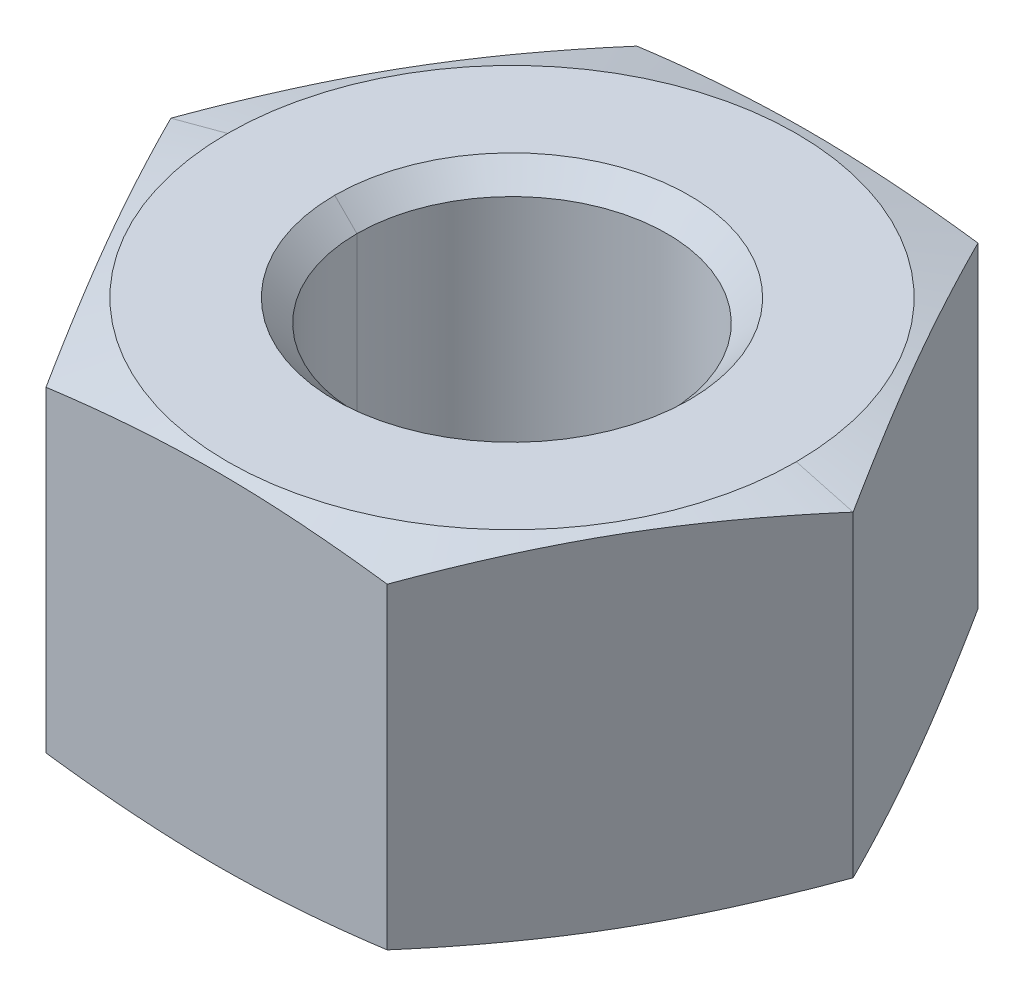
ISO-10303-21;
HEADER;
FILE_DESCRIPTION(('STEP AP214'),'2;1');
FILE_NAME('part.step','',(''),(''),'','','');
FILE_SCHEMA(('AUTOMOTIVE_DESIGN { 1 0 10303 214 1 1 1 1 }'));
ENDSEC;
DATA;
#1=APPLICATION_CONTEXT('core data for automotive mechanical design processes');
#2=APPLICATION_PROTOCOL_DEFINITION('international standard','automotive_design',2000,#1);
#3=PRODUCT_CONTEXT('',#1,'mechanical');
#4=PRODUCT('Part','Part','',(#3));
#5=PRODUCT_RELATED_PRODUCT_CATEGORY('part','',(#4));
#6=PRODUCT_DEFINITION_FORMATION('','',#4);
#7=PRODUCT_DEFINITION_CONTEXT('part definition',#1,'design');
#8=PRODUCT_DEFINITION('design','',#6,#7);
#9=PRODUCT_DEFINITION_SHAPE('','',#8);
#10=(LENGTH_UNIT() NAMED_UNIT(*) SI_UNIT(.MILLI.,.METRE.));
#11=(NAMED_UNIT(*) PLANE_ANGLE_UNIT() SI_UNIT($,.RADIAN.));
#12=(NAMED_UNIT(*) SI_UNIT($,.STERADIAN.) SOLID_ANGLE_UNIT());
#13=UNCERTAINTY_MEASURE_WITH_UNIT(LENGTH_MEASURE(1.E-05),#10,'distance_accuracy_value','');
#14=(GEOMETRIC_REPRESENTATION_CONTEXT(3) GLOBAL_UNCERTAINTY_ASSIGNED_CONTEXT((#13)) GLOBAL_UNIT_ASSIGNED_CONTEXT((#10,
#11,#12)) REPRESENTATION_CONTEXT('',''));
#15=CARTESIAN_POINT('',(0.,0.,0.));
#16=DIRECTION('',(0.,0.,1.));
#17=DIRECTION('',(1.,0.,0.));
#18=AXIS2_PLACEMENT_3D('',#15,#16,#17);
#19=CARTESIAN_POINT('',(131.9,7.,32.4989878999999));
#20=DIRECTION('',(0.,1.,0.));
#21=DIRECTION('',(1.,0.,0.));
#22=AXIS2_PLACEMENT_3D('',#19,#20,#21);
#23=CONICAL_SURFACE('',#22,2.4,0.785398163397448);
#24=DIRECTION('',(-0.707106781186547,0.707106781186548,0.));
#25=VECTOR('',#24,1.);
#26=CARTESIAN_POINT('',(129.5,7.,32.4989878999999));
#27=LINE('',#26,#25);
#28=CARTESIAN_POINT('',(129.8,6.7,32.4989878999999));
#29=VERTEX_POINT('',#28);
#30=CARTESIAN_POINT('',(129.5,7.,32.4989878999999));
#31=VERTEX_POINT('',#30);
#32=EDGE_CURVE('E165',#29,#31,#27,.T.);
#33=ORIENTED_EDGE('',*,*,#32,.F.);
#34=CARTESIAN_POINT('',(131.9,6.7,32.4989878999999));
#35=DIRECTION('',(0.,1.,0.));
#36=DIRECTION('',(1.,0.,0.));
#37=AXIS2_PLACEMENT_3D('',#34,#35,#36);
#38=CIRCLE('',#37,2.1);
#39=CARTESIAN_POINT('',(134.,6.7,32.4989878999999));
#40=VERTEX_POINT('',#39);
#41=EDGE_CURVE('E27',#40,#29,#38,.T.);
#42=ORIENTED_EDGE('',*,*,#41,.F.);
#43=DIRECTION('',(0.707106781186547,0.707106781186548,0.));
#44=VECTOR('',#43,1.);
#45=CARTESIAN_POINT('',(134.3,7.,32.4989878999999));
#46=LINE('',#45,#44);
#47=CARTESIAN_POINT('',(134.3,7.,32.4989878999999));
#48=VERTEX_POINT('',#47);
#49=EDGE_CURVE('E173',#40,#48,#46,.T.);
#50=ORIENTED_EDGE('',*,*,#49,.T.);
#51=CARTESIAN_POINT('',(131.9,7.,32.4989878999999));
#52=DIRECTION('',(0.,-1.,0.));
#53=DIRECTION('',(1.,0.,0.));
#54=AXIS2_PLACEMENT_3D('',#51,#52,#53);
#55=CIRCLE('',#54,2.4);
#56=EDGE_CURVE('E151',#31,#48,#55,.T.);
#57=ORIENTED_EDGE('',*,*,#56,.F.);
#58=EDGE_LOOP('',(#33,#42,#50,#57));
#59=FACE_BOUND('',#58,.T.);
#60=ADVANCED_FACE('F16',(#59),#23,.F.);
#61=CARTESIAN_POINT('',(131.9,2.6,32.4989878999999));
#62=DIRECTION('',(0.,-1.,0.));
#63=DIRECTION('',(-1.,0.,0.));
#64=AXIS2_PLACEMENT_3D('',#61,#62,#63);
#65=CONICAL_SURFACE('',#64,2.1,0.78539816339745);
#66=DIRECTION('',(0.707106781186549,-0.707106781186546,0.));
#67=VECTOR('',#66,1.);
#68=CARTESIAN_POINT('',(134.,2.6,32.4989878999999));
#69=LINE('',#68,#67);
#70=CARTESIAN_POINT('',(134.,2.6,32.4989878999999));
#71=VERTEX_POINT('',#70);
#72=CARTESIAN_POINT('',(134.3,2.3,32.4989878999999));
#73=VERTEX_POINT('',#72);
#74=EDGE_CURVE('E184',#71,#73,#69,.T.);
#75=ORIENTED_EDGE('',*,*,#74,.F.);
#76=CARTESIAN_POINT('',(131.9,2.6,32.4989878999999));
#77=DIRECTION('',(0.,-1.,0.));
#78=DIRECTION('',(1.,0.,0.));
#79=AXIS2_PLACEMENT_3D('',#76,#77,#78);
#80=CIRCLE('',#79,2.1);
#81=CARTESIAN_POINT('',(129.8,2.6,32.4989878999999));
#82=VERTEX_POINT('',#81);
#83=EDGE_CURVE('E11',#82,#71,#80,.T.);
#84=ORIENTED_EDGE('',*,*,#83,.F.);
#85=DIRECTION('',(-0.707106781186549,-0.707106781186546,0.));
#86=VECTOR('',#85,1.);
#87=CARTESIAN_POINT('',(129.8,2.6,32.4989878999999));
#88=LINE('',#87,#86);
#89=CARTESIAN_POINT('',(129.5,2.3,32.4989878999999));
#90=VERTEX_POINT('',#89);
#91=EDGE_CURVE('E193',#82,#90,#88,.T.);
#92=ORIENTED_EDGE('',*,*,#91,.T.);
#93=CARTESIAN_POINT('',(131.9,2.3,32.4989878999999));
#94=DIRECTION('',(0.,1.,0.));
#95=DIRECTION('',(1.,0.,0.));
#96=AXIS2_PLACEMENT_3D('',#93,#94,#95);
#97=CIRCLE('',#96,2.4);
#98=EDGE_CURVE('E197',#73,#90,#97,.T.);
#99=ORIENTED_EDGE('',*,*,#98,.F.);
#100=EDGE_LOOP('',(#75,#84,#92,#99));
#101=FACE_BOUND('',#100,.T.);
#102=ADVANCED_FACE('F547',(#101),#65,.F.);
#103=CARTESIAN_POINT('',(131.9,2.3,32.4989878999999));
#104=DIRECTION('',(0.,-1.,0.));
#105=DIRECTION('',(-1.,0.,0.));
#106=AXIS2_PLACEMENT_3D('',#103,#104,#105);
#107=CYLINDRICAL_SURFACE('',#106,2.1);
#108=DIRECTION('',(0.,-1.,0.));
#109=VECTOR('',#108,1.);
#110=CARTESIAN_POINT('',(134.,2.3,32.4989878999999));
#111=LINE('',#110,#109);
#112=EDGE_CURVE('E145',#40,#71,#111,.T.);
#113=ORIENTED_EDGE('',*,*,#112,.F.);
#114=ORIENTED_EDGE('',*,*,#41,.T.);
#115=DIRECTION('',(0.,-1.,0.));
#116=VECTOR('',#115,1.);
#117=CARTESIAN_POINT('',(129.8,2.3,32.4989878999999));
#118=LINE('',#117,#116);
#119=EDGE_CURVE('E142',#29,#82,#118,.T.);
#120=ORIENTED_EDGE('',*,*,#119,.T.);
#121=ORIENTED_EDGE('',*,*,#83,.T.);
#122=EDGE_LOOP('',(#113,#114,#120,#121));
#123=FACE_BOUND('',#122,.T.);
#124=ADVANCED_FACE('F141',(#123),#107,.F.);
#125=CARTESIAN_POINT('',(134.209401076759,7.,36.4989879));
#126=DIRECTION('',(0.,1.,0.));
#127=DIRECTION('',(1.,0.,0.));
#128=AXIS2_PLACEMENT_3D('',#125,#126,#127);
#129=PLANE('',#128);
#130=CARTESIAN_POINT('',(131.9,7.,32.4989878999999));
#131=DIRECTION('',(0.,-1.,0.));
#132=DIRECTION('',(1.,0.,0.));
#133=AXIS2_PLACEMENT_3D('',#130,#131,#132);
#134=CIRCLE('',#133,2.4);
#135=EDGE_CURVE('E170',#48,#31,#134,.T.);
#136=ORIENTED_EDGE('',*,*,#135,.T.);
#137=ORIENTED_EDGE('',*,*,#56,.T.);
#138=EDGE_LOOP('',(#136,#137));
#139=FACE_BOUND('',#138,.T.);
#140=CARTESIAN_POINT('',(131.9,7.,32.4989878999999));
#141=DIRECTION('',(0.,-1.,0.));
#142=DIRECTION('',(-1.,0.,0.));
#143=AXIS2_PLACEMENT_3D('',#140,#141,#142);
#144=CIRCLE('',#143,3.85);
#145=CARTESIAN_POINT('',(128.05,7.,32.4989878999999));
#146=VERTEX_POINT('',#145);
#147=CARTESIAN_POINT('',(135.75,7.,32.4989878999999));
#148=VERTEX_POINT('',#147);
#149=EDGE_CURVE('E162',#146,#148,#144,.T.);
#150=ORIENTED_EDGE('',*,*,#149,.F.);
#151=CARTESIAN_POINT('',(131.9,7.,32.4989878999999));
#152=DIRECTION('',(0.,-1.,0.));
#153=DIRECTION('',(-1.,0.,0.));
#154=AXIS2_PLACEMENT_3D('',#151,#152,#153);
#155=CIRCLE('',#154,3.85);
#156=EDGE_CURVE('E194',#148,#146,#155,.T.);
#157=ORIENTED_EDGE('',*,*,#156,.F.);
#158=EDGE_LOOP('',(#150,#157));
#159=FACE_BOUND('',#158,.T.);
#160=ADVANCED_FACE('F269',(#139,#159),#129,.T.);
#161=CARTESIAN_POINT('',(131.9,7.,32.4989878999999));
#162=DIRECTION('',(0.,-1.,0.));
#163=DIRECTION('',(-1.,0.,0.));
#164=AXIS2_PLACEMENT_3D('',#161,#162,#163);
#165=CONICAL_SURFACE('',#164,3.85,1.30899693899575);
#166=DIRECTION('',(0.96592582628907,-0.258819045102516,0.));
#167=VECTOR('',#166,1.);
#168=CARTESIAN_POINT('',(135.75,7.,32.4989878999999));
#169=LINE('',#168,#167);
#170=CARTESIAN_POINT('',(136.518802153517,6.79400008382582,32.4989878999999));
#171=VERTEX_POINT('',#170);
#172=EDGE_CURVE('E206',#148,#171,#169,.T.);
#173=ORIENTED_EDGE('',*,*,#172,.F.);
#174=ORIENTED_EDGE('',*,*,#156,.T.);
#175=DIRECTION('',(-0.96592582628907,-0.258819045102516,0.));
#176=VECTOR('',#175,1.);
#177=CARTESIAN_POINT('',(128.05,7.,32.4989878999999));
#178=LINE('',#177,#176);
#179=CARTESIAN_POINT('',(127.281197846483,6.79400008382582,32.4989878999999));
#180=VERTEX_POINT('',#179);
#181=EDGE_CURVE('E212',#146,#180,#178,.T.);
#182=ORIENTED_EDGE('',*,*,#181,.T.);
#183=CARTESIAN_POINT('',(129.590598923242,6.79400008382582,36.4989879));
#184=CARTESIAN_POINT('',(128.971948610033,6.959766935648,35.4274541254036));
#185=CARTESIAN_POINT('',(128.435898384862,6.95980762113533,34.4989878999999));
#186=CARTESIAN_POINT('',(127.900151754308,6.95984828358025,33.5710475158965));
#187=CARTESIAN_POINT('',(127.281197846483,6.79400008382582,32.4989878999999));
#188=B_SPLINE_CURVE_WITH_KNOTS('',2,(#183,#184,#185,#186,#187),.UNSPECIFIED.,.F.,.F.,(3,2,3),
(0.,0.5,1.),.UNSPECIFIED.);
#189=CARTESIAN_POINT('',(129.590598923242,6.79400008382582,36.4989879));
#190=VERTEX_POINT('',#189);
#191=EDGE_CURVE('E50',#190,#180,#188,.T.);
#192=ORIENTED_EDGE('',*,*,#191,.F.);
#193=CARTESIAN_POINT('',(134.209401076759,6.79400008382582,36.4989879));
#194=CARTESIAN_POINT('',(132.974256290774,6.95947810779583,36.4989879));
#195=CARTESIAN_POINT('',(131.904046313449,6.95980707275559,36.4989879));
#196=CARTESIAN_POINT('',(130.830661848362,6.96013701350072,36.4989879));
#197=CARTESIAN_POINT('',(129.590598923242,6.79400008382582,36.4989879));
#198=B_SPLINE_CURVE_WITH_KNOTS('',2,(#193,#194,#195,#196,#197),.UNSPECIFIED.,.F.,.F.,(3,2,3),
(0.,0.5,1.),.UNSPECIFIED.);
#199=CARTESIAN_POINT('',(134.209401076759,6.79400008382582,36.4989879));
#200=VERTEX_POINT('',#199);
#201=EDGE_CURVE('E327',#200,#190,#198,.T.);
#202=ORIENTED_EDGE('',*,*,#201,.F.);
#203=CARTESIAN_POINT('',(136.518802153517,6.79400008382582,32.4989878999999));
#204=CARTESIAN_POINT('',(135.900151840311,6.95976693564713,33.5705216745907));
#205=CARTESIAN_POINT('',(135.364101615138,6.95980762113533,34.4989878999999));
#206=CARTESIAN_POINT('',(134.828354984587,6.95984828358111,35.4269282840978));
#207=CARTESIAN_POINT('',(134.209401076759,6.79400008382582,36.4989879));
#208=B_SPLINE_CURVE_WITH_KNOTS('',2,(#203,#204,#205,#206,#207),.UNSPECIFIED.,.F.,.F.,(3,2,3),
(0.,0.5,1.),.UNSPECIFIED.);
#209=EDGE_CURVE('E512',#171,#200,#208,.T.);
#210=ORIENTED_EDGE('',*,*,#209,.F.);
#211=EDGE_LOOP('',(#173,#174,#182,#192,#202,#210));
#212=FACE_BOUND('',#211,.T.);
#213=ADVANCED_FACE('F258',(#212),#165,.T.);
#214=CARTESIAN_POINT('',(134.209401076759,2.3,36.4989879));
#215=DIRECTION('',(0.,1.,0.));
#216=DIRECTION('',(1.,0.,0.));
#217=AXIS2_PLACEMENT_3D('',#214,#215,#216);
#218=PLANE('',#217);
#219=CARTESIAN_POINT('',(131.9,2.3,32.4989878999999));
#220=DIRECTION('',(0.,1.,0.));
#221=DIRECTION('',(1.,0.,0.));
#222=AXIS2_PLACEMENT_3D('',#219,#220,#221);
#223=CIRCLE('',#222,2.4);
#224=EDGE_CURVE('E189',#90,#73,#223,.T.);
#225=ORIENTED_EDGE('',*,*,#224,.T.);
#226=ORIENTED_EDGE('',*,*,#98,.T.);
#227=EDGE_LOOP('',(#225,#226));
#228=FACE_BOUND('',#227,.T.);
#229=CARTESIAN_POINT('',(131.9,2.3,32.4989878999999));
#230=DIRECTION('',(0.,-1.,0.));
#231=DIRECTION('',(-1.,0.,0.));
#232=AXIS2_PLACEMENT_3D('',#229,#230,#231);
#233=CIRCLE('',#232,3.85);
#234=CARTESIAN_POINT('',(135.75,2.3,32.4989878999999));
#235=VERTEX_POINT('',#234);
#236=CARTESIAN_POINT('',(128.05,2.3,32.4989878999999));
#237=VERTEX_POINT('',#236);
#238=EDGE_CURVE('E213',#235,#237,#233,.T.);
#239=ORIENTED_EDGE('',*,*,#238,.T.);
#240=CARTESIAN_POINT('',(131.9,2.3,32.4989878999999));
#241=DIRECTION('',(0.,-1.,0.));
#242=DIRECTION('',(-1.,0.,0.));
#243=AXIS2_PLACEMENT_3D('',#240,#241,#242);
#244=CIRCLE('',#243,3.85);
#245=EDGE_CURVE('E207',#237,#235,#244,.T.);
#246=ORIENTED_EDGE('',*,*,#245,.T.);
#247=EDGE_LOOP('',(#239,#246));
#248=FACE_BOUND('',#247,.T.);
#249=ADVANCED_FACE('F268',(#228,#248),#218,.F.);
#250=CARTESIAN_POINT('',(131.9,2.50599991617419,32.4989878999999));
#251=DIRECTION('',(0.,1.,0.));
#252=DIRECTION('',(1.,0.,0.));
#253=AXIS2_PLACEMENT_3D('',#250,#251,#252);
#254=CONICAL_SURFACE('',#253,4.61880215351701,1.30899693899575);
#255=DIRECTION('',(-0.96592582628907,0.258819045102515,0.));
#256=VECTOR('',#255,1.);
#257=CARTESIAN_POINT('',(127.281197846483,2.50599991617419,32.4989878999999));
#258=LINE('',#257,#256);
#259=CARTESIAN_POINT('',(127.281197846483,2.50599991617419,32.4989878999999));
#260=VERTEX_POINT('',#259);
#261=EDGE_CURVE('E211',#237,#260,#258,.T.);
#262=ORIENTED_EDGE('',*,*,#261,.F.);
#263=ORIENTED_EDGE('',*,*,#238,.F.);
#264=DIRECTION('',(0.96592582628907,0.258819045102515,0.));
#265=VECTOR('',#264,1.);
#266=CARTESIAN_POINT('',(136.518802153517,2.50599991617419,32.4989878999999));
#267=LINE('',#266,#265);
#268=CARTESIAN_POINT('',(136.518802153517,2.50599991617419,32.4989878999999));
#269=VERTEX_POINT('',#268);
#270=EDGE_CURVE('E496',#235,#269,#267,.T.);
#271=ORIENTED_EDGE('',*,*,#270,.T.);
#272=CARTESIAN_POINT('',(134.209401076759,2.50599991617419,36.4989879));
#273=CARTESIAN_POINT('',(134.828051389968,2.340233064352,35.4274541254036));
#274=CARTESIAN_POINT('',(135.364101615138,2.34019237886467,34.4989878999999));
#275=CARTESIAN_POINT('',(135.899848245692,2.34015171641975,33.5710475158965));
#276=CARTESIAN_POINT('',(136.518802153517,2.50599991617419,32.4989878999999));
#277=B_SPLINE_CURVE_WITH_KNOTS('',2,(#272,#273,#274,#275,#276),.UNSPECIFIED.,.F.,.F.,(3,2,3),
(0.,0.5,1.),.UNSPECIFIED.);
#278=CARTESIAN_POINT('',(134.209401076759,2.50599991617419,36.4989879));
#279=VERTEX_POINT('',#278);
#280=EDGE_CURVE('E526',#279,#269,#277,.T.);
#281=ORIENTED_EDGE('',*,*,#280,.F.);
#282=CARTESIAN_POINT('',(129.590598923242,2.50599991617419,36.4989879));
#283=CARTESIAN_POINT('',(130.830089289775,2.33993969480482,36.4989879));
#284=CARTESIAN_POINT('',(131.904046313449,2.3401929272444,36.4989879));
#285=CARTESIAN_POINT('',(132.973683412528,2.34044514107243,36.4989879));
#286=CARTESIAN_POINT('',(134.209401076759,2.50599991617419,36.4989879));
#287=B_SPLINE_CURVE_WITH_KNOTS('',2,(#282,#283,#284,#285,#286),.UNSPECIFIED.,.F.,.F.,(3,2,3),
(0.,0.5,1.),.UNSPECIFIED.);
#288=CARTESIAN_POINT('',(129.590598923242,2.50599991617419,36.4989879));
#289=VERTEX_POINT('',#288);
#290=EDGE_CURVE('E296',#289,#279,#287,.T.);
#291=ORIENTED_EDGE('',*,*,#290,.F.);
#292=CARTESIAN_POINT('',(127.281197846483,2.50599991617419,32.4989878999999));
#293=CARTESIAN_POINT('',(127.899848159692,2.340233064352,33.5705216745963));
#294=CARTESIAN_POINT('',(128.435898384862,2.34019237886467,34.4989878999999));
#295=CARTESIAN_POINT('',(128.971645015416,2.34015171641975,35.4269282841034));
#296=CARTESIAN_POINT('',(129.590598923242,2.50599991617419,36.4989879));
#297=B_SPLINE_CURVE_WITH_KNOTS('',2,(#292,#293,#294,#295,#296),.UNSPECIFIED.,.F.,.F.,(3,2,3),
(0.,0.5,1.),.UNSPECIFIED.);
#298=EDGE_CURVE('E39',#260,#289,#297,.T.);
#299=ORIENTED_EDGE('',*,*,#298,.F.);
#300=EDGE_LOOP('',(#262,#263,#271,#281,#291,#299));
#301=FACE_BOUND('',#300,.T.);
#302=ADVANCED_FACE('F235',(#301),#254,.T.);
#303=CARTESIAN_POINT('',(127.281197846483,7.,32.4989878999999));
#304=DIRECTION('',(0.866025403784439,0.,-0.5));
#305=DIRECTION('',(0.,-1.,0.));
#306=AXIS2_PLACEMENT_3D('',#303,#304,#305);
#307=PLANE('',#306);
#308=DIRECTION('',(0.,-1.,0.));
#309=VECTOR('',#308,1.);
#310=CARTESIAN_POINT('',(129.590598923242,7.,36.4989879));
#311=LINE('',#310,#309);
#312=EDGE_CURVE('E486',#190,#289,#311,.T.);
#313=ORIENTED_EDGE('',*,*,#312,.F.);
#314=ORIENTED_EDGE('',*,*,#191,.T.);
#315=DIRECTION('',(0.,-1.,0.));
#316=VECTOR('',#315,1.);
#317=CARTESIAN_POINT('',(127.281197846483,7.,32.4989878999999));
#318=LINE('',#317,#316);
#319=EDGE_CURVE('E448',#180,#260,#318,.T.);
#320=ORIENTED_EDGE('',*,*,#319,.T.);
#321=ORIENTED_EDGE('',*,*,#298,.T.);
#322=EDGE_LOOP('',(#313,#314,#320,#321));
#323=FACE_BOUND('',#322,.T.);
#324=ADVANCED_FACE('F225',(#323),#307,.F.);
#325=CARTESIAN_POINT('',(129.590598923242,7.,28.4989878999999));
#326=DIRECTION('',(0.866025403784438,0.,0.5));
#327=DIRECTION('',(0.,-1.,0.));
#328=AXIS2_PLACEMENT_3D('',#325,#326,#327);
#329=PLANE('',#328);
#330=ORIENTED_EDGE('',*,*,#319,.F.);
#331=CARTESIAN_POINT('',(127.281197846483,6.79400008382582,32.4989878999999));
#332=CARTESIAN_POINT('',(127.899848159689,6.95976693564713,31.4274541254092));
#333=CARTESIAN_POINT('',(128.435898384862,6.95980762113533,30.4989879));
#334=CARTESIAN_POINT('',(128.971645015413,6.95984828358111,29.5710475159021));
#335=CARTESIAN_POINT('',(129.590598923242,6.79400008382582,28.4989878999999));
#336=B_SPLINE_CURVE_WITH_KNOTS('',2,(#331,#332,#333,#334,#335),.UNSPECIFIED.,.F.,.F.,(3,2,3),
(0.,0.5,1.),.UNSPECIFIED.);
#337=CARTESIAN_POINT('',(129.590598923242,6.79400008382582,28.4989878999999));
#338=VERTEX_POINT('',#337);
#339=EDGE_CURVE('E381',#180,#338,#336,.T.);
#340=ORIENTED_EDGE('',*,*,#339,.T.);
#341=DIRECTION('',(0.,-1.,0.));
#342=VECTOR('',#341,1.);
#343=CARTESIAN_POINT('',(129.590598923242,7.,28.4989878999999));
#344=LINE('',#343,#342);
#345=CARTESIAN_POINT('',(129.590598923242,2.50599991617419,28.4989878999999));
#346=VERTEX_POINT('',#345);
#347=EDGE_CURVE('E440',#338,#346,#344,.T.);
#348=ORIENTED_EDGE('',*,*,#347,.T.);
#349=CARTESIAN_POINT('',(129.590598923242,2.50599991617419,28.4989878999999));
#350=CARTESIAN_POINT('',(128.971948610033,2.340233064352,29.5705216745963));
#351=CARTESIAN_POINT('',(128.435898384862,2.34019237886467,30.4989879));
#352=CARTESIAN_POINT('',(127.900151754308,2.34015171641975,31.4269282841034));
#353=CARTESIAN_POINT('',(127.281197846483,2.50599991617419,32.4989878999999));
#354=B_SPLINE_CURVE_WITH_KNOTS('',2,(#349,#350,#351,#352,#353),.UNSPECIFIED.,.F.,.F.,(3,2,3),
(0.,0.5,1.),.UNSPECIFIED.);
#355=EDGE_CURVE('E454',#346,#260,#354,.T.);
#356=ORIENTED_EDGE('',*,*,#355,.T.);
#357=EDGE_LOOP('',(#330,#340,#348,#356));
#358=FACE_BOUND('',#357,.T.);
#359=ADVANCED_FACE('F234',(#358),#329,.F.);
#360=CARTESIAN_POINT('',(134.209401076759,7.,28.4989878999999));
#361=DIRECTION('',(0.,0.,1.));
#362=DIRECTION('',(0.,-1.,0.));
#363=AXIS2_PLACEMENT_3D('',#360,#361,#362);
#364=PLANE('',#363);
#365=ORIENTED_EDGE('',*,*,#347,.F.);
#366=CARTESIAN_POINT('',(129.590598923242,6.79400008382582,28.4989878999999));
#367=CARTESIAN_POINT('',(130.830089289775,6.96006030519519,28.4989878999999));
#368=CARTESIAN_POINT('',(131.904046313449,6.9598070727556,28.4989878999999));
#369=CARTESIAN_POINT('',(132.973683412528,6.95955485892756,28.4989878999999));
#370=CARTESIAN_POINT('',(134.209401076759,6.79400008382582,28.4989878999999));
#371=B_SPLINE_CURVE_WITH_KNOTS('',2,(#366,#367,#368,#369,#370),.UNSPECIFIED.,.F.,.F.,(3,2,3),
(0.,0.5,1.),.UNSPECIFIED.);
#372=CARTESIAN_POINT('',(134.209401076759,6.79400008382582,28.4989878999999));
#373=VERTEX_POINT('',#372);
#374=EDGE_CURVE('E376',#338,#373,#371,.T.);
#375=ORIENTED_EDGE('',*,*,#374,.T.);
#376=DIRECTION('',(0.,-1.,0.));
#377=VECTOR('',#376,1.);
#378=CARTESIAN_POINT('',(134.209401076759,7.,28.4989878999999));
#379=LINE('',#378,#377);
#380=CARTESIAN_POINT('',(134.209401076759,2.50599991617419,28.4989878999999));
#381=VERTEX_POINT('',#380);
#382=EDGE_CURVE('E449',#373,#381,#379,.T.);
#383=ORIENTED_EDGE('',*,*,#382,.T.);
#384=CARTESIAN_POINT('',(134.209401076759,2.50599991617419,28.4989878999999));
#385=CARTESIAN_POINT('',(132.974256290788,2.34052189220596,28.4989878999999));
#386=CARTESIAN_POINT('',(131.904046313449,2.3401929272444,28.4989878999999));
#387=CARTESIAN_POINT('',(130.830661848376,2.33986298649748,28.4989878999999));
#388=CARTESIAN_POINT('',(129.590598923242,2.50599991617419,28.4989878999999));
#389=B_SPLINE_CURVE_WITH_KNOTS('',2,(#384,#385,#386,#387,#388),.UNSPECIFIED.,.F.,.F.,(3,2,3),
(0.,0.5,1.),.UNSPECIFIED.);
#390=EDGE_CURVE('E436',#381,#346,#389,.T.);
#391=ORIENTED_EDGE('',*,*,#390,.T.);
#392=EDGE_LOOP('',(#365,#375,#383,#391));
#393=FACE_BOUND('',#392,.T.);
#394=ADVANCED_FACE('F356',(#393),#364,.F.);
#395=CARTESIAN_POINT('',(136.518802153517,7.,32.4989878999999));
#396=DIRECTION('',(-0.866025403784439,0.,0.5));
#397=DIRECTION('',(-0.5,0.,-0.866025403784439));
#398=AXIS2_PLACEMENT_3D('',#395,#396,#397);
#399=PLANE('',#398);
#400=ORIENTED_EDGE('',*,*,#382,.F.);
#401=CARTESIAN_POINT('',(134.209401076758,6.79400008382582,28.4989878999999));
#402=CARTESIAN_POINT('',(134.828051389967,6.959766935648,29.5705216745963));
#403=CARTESIAN_POINT('',(135.364101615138,6.95980762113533,30.4989879));
#404=CARTESIAN_POINT('',(135.899848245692,6.95984828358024,31.4269282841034));
#405=CARTESIAN_POINT('',(136.518802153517,6.79400008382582,32.4989878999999));
#406=B_SPLINE_CURVE_WITH_KNOTS('',2,(#401,#402,#403,#404,#405),.UNSPECIFIED.,.F.,.F.,(3,2,3),
(0.,0.5,1.),.UNSPECIFIED.);
#407=EDGE_CURVE('E288',#373,#171,#406,.T.);
#408=ORIENTED_EDGE('',*,*,#407,.T.);
#409=DIRECTION('',(0.,-1.,0.));
#410=VECTOR('',#409,1.);
#411=CARTESIAN_POINT('',(136.518802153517,7.,32.4989878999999));
#412=LINE('',#411,#410);
#413=EDGE_CURVE('E492',#171,#269,#412,.T.);
#414=ORIENTED_EDGE('',*,*,#413,.T.);
#415=CARTESIAN_POINT('',(136.518802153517,2.50599991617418,32.4989878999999));
#416=CARTESIAN_POINT('',(135.900151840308,2.340233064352,31.4274541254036));
#417=CARTESIAN_POINT('',(135.364101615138,2.34019237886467,30.4989879));
#418=CARTESIAN_POINT('',(134.828354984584,2.34015171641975,29.5710475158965));
#419=CARTESIAN_POINT('',(134.209401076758,2.50599991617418,28.4989878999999));
#420=B_SPLINE_CURVE_WITH_KNOTS('',2,(#415,#416,#417,#418,#419),.UNSPECIFIED.,.F.,.F.,(3,2,3),
(0.,0.5,1.),.UNSPECIFIED.);
#421=EDGE_CURVE('E341',#269,#381,#420,.T.);
#422=ORIENTED_EDGE('',*,*,#421,.T.);
#423=EDGE_LOOP('',(#400,#408,#414,#422));
#424=FACE_BOUND('',#423,.T.);
#425=ADVANCED_FACE('F348',(#424),#399,.F.);
#426=CARTESIAN_POINT('',(134.209401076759,7.,36.4989879));
#427=DIRECTION('',(-0.866025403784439,0.,-0.5));
#428=DIRECTION('',(0.,1.,0.));
#429=AXIS2_PLACEMENT_3D('',#426,#427,#428);
#430=PLANE('',#429);
#431=ORIENTED_EDGE('',*,*,#413,.F.);
#432=ORIENTED_EDGE('',*,*,#209,.T.);
#433=DIRECTION('',(0.,-1.,0.));
#434=VECTOR('',#433,1.);
#435=CARTESIAN_POINT('',(134.209401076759,7.,36.4989879));
#436=LINE('',#435,#434);
#437=EDGE_CURVE('E493',#200,#279,#436,.T.);
#438=ORIENTED_EDGE('',*,*,#437,.T.);
#439=ORIENTED_EDGE('',*,*,#280,.T.);
#440=EDGE_LOOP('',(#431,#432,#438,#439));
#441=FACE_BOUND('',#440,.T.);
#442=ADVANCED_FACE('F313',(#441),#430,.F.);
#443=CARTESIAN_POINT('',(129.590598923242,7.,36.4989879));
#444=DIRECTION('',(0.,0.,-1.));
#445=DIRECTION('',(1.,0.,0.));
#446=AXIS2_PLACEMENT_3D('',#443,#444,#445);
#447=PLANE('',#446);
#448=ORIENTED_EDGE('',*,*,#437,.F.);
#449=ORIENTED_EDGE('',*,*,#201,.T.);
#450=ORIENTED_EDGE('',*,*,#312,.T.);
#451=ORIENTED_EDGE('',*,*,#290,.T.);
#452=EDGE_LOOP('',(#448,#449,#450,#451));
#453=FACE_BOUND('',#452,.T.);
#454=ADVANCED_FACE('F303',(#453),#447,.F.);
#455=CARTESIAN_POINT('',(131.9,2.50599991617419,32.4989878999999));
#456=DIRECTION('',(0.,1.,0.));
#457=DIRECTION('',(1.,0.,0.));
#458=AXIS2_PLACEMENT_3D('',#455,#456,#457);
#459=CONICAL_SURFACE('',#458,4.61880215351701,1.30899693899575);
#460=ORIENTED_EDGE('',*,*,#245,.F.);
#461=ORIENTED_EDGE('',*,*,#261,.T.);
#462=ORIENTED_EDGE('',*,*,#355,.F.);
#463=ORIENTED_EDGE('',*,*,#390,.F.);
#464=ORIENTED_EDGE('',*,*,#421,.F.);
#465=ORIENTED_EDGE('',*,*,#270,.F.);
#466=EDGE_LOOP('',(#460,#461,#462,#463,#464,#465));
#467=FACE_BOUND('',#466,.T.);
#468=ADVANCED_FACE('F312',(#467),#459,.T.);
#469=CARTESIAN_POINT('',(131.9,7.,32.4989878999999));
#470=DIRECTION('',(0.,-1.,0.));
#471=DIRECTION('',(-1.,0.,0.));
#472=AXIS2_PLACEMENT_3D('',#469,#470,#471);
#473=CONICAL_SURFACE('',#472,3.85,1.30899693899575);
#474=ORIENTED_EDGE('',*,*,#149,.T.);
#475=ORIENTED_EDGE('',*,*,#172,.T.);
#476=ORIENTED_EDGE('',*,*,#407,.F.);
#477=ORIENTED_EDGE('',*,*,#374,.F.);
#478=ORIENTED_EDGE('',*,*,#339,.F.);
#479=ORIENTED_EDGE('',*,*,#181,.F.);
#480=EDGE_LOOP('',(#474,#475,#476,#477,#478,#479));
#481=FACE_BOUND('',#480,.T.);
#482=ADVANCED_FACE('F238',(#481),#473,.T.);
#483=CARTESIAN_POINT('',(131.9,2.3,32.4989878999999));
#484=DIRECTION('',(0.,-1.,0.));
#485=DIRECTION('',(-1.,0.,0.));
#486=AXIS2_PLACEMENT_3D('',#483,#484,#485);
#487=CYLINDRICAL_SURFACE('',#486,2.1);
#488=CARTESIAN_POINT('',(131.9,6.7,32.4989878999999));
#489=DIRECTION('',(0.,1.,0.));
#490=DIRECTION('',(1.,0.,0.));
#491=AXIS2_PLACEMENT_3D('',#488,#489,#490);
#492=CIRCLE('',#491,2.1);
#493=EDGE_CURVE('E158',#29,#40,#492,.T.);
#494=ORIENTED_EDGE('',*,*,#493,.T.);
#495=ORIENTED_EDGE('',*,*,#112,.T.);
#496=CARTESIAN_POINT('',(131.9,2.6,32.4989878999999));
#497=DIRECTION('',(0.,-1.,0.));
#498=DIRECTION('',(1.,0.,0.));
#499=AXIS2_PLACEMENT_3D('',#496,#497,#498);
#500=CIRCLE('',#499,2.1);
#501=EDGE_CURVE('E160',#71,#82,#500,.T.);
#502=ORIENTED_EDGE('',*,*,#501,.T.);
#503=ORIENTED_EDGE('',*,*,#119,.F.);
#504=EDGE_LOOP('',(#494,#495,#502,#503));
#505=FACE_BOUND('',#504,.T.);
#506=ADVANCED_FACE('F156',(#505),#487,.F.);
#507=CARTESIAN_POINT('',(131.9,2.6,32.4989878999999));
#508=DIRECTION('',(0.,-1.,0.));
#509=DIRECTION('',(-1.,0.,0.));
#510=AXIS2_PLACEMENT_3D('',#507,#508,#509);
#511=CONICAL_SURFACE('',#510,2.1,0.78539816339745);
#512=ORIENTED_EDGE('',*,*,#501,.F.);
#513=ORIENTED_EDGE('',*,*,#74,.T.);
#514=ORIENTED_EDGE('',*,*,#224,.F.);
#515=ORIENTED_EDGE('',*,*,#91,.F.);
#516=EDGE_LOOP('',(#512,#513,#514,#515));
#517=FACE_BOUND('',#516,.T.);
#518=ADVANCED_FACE('F558',(#517),#511,.F.);
#519=CARTESIAN_POINT('',(131.9,7.,32.4989878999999));
#520=DIRECTION('',(0.,1.,0.));
#521=DIRECTION('',(1.,0.,0.));
#522=AXIS2_PLACEMENT_3D('',#519,#520,#521);
#523=CONICAL_SURFACE('',#522,2.4,0.785398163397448);
#524=ORIENTED_EDGE('',*,*,#493,.F.);
#525=ORIENTED_EDGE('',*,*,#32,.T.);
#526=ORIENTED_EDGE('',*,*,#135,.F.);
#527=ORIENTED_EDGE('',*,*,#49,.F.);
#528=EDGE_LOOP('',(#524,#525,#526,#527));
#529=FACE_BOUND('',#528,.T.);
#530=ADVANCED_FACE('F172',(#529),#523,.F.);
#531=CLOSED_SHELL('',(#60,#102,#124,#160,#213,#249,#302,#324,#359,#394,#425,#442,#454,#468,#482,
#506,#518,#530));
#532=MANIFOLD_SOLID_BREP('B1',#531);
#533=ADVANCED_BREP_SHAPE_REPRESENTATION('',(#18,#532),#14);
#534=SHAPE_DEFINITION_REPRESENTATION(#9,#533);
ENDSEC;
END-ISO-10303-21;
